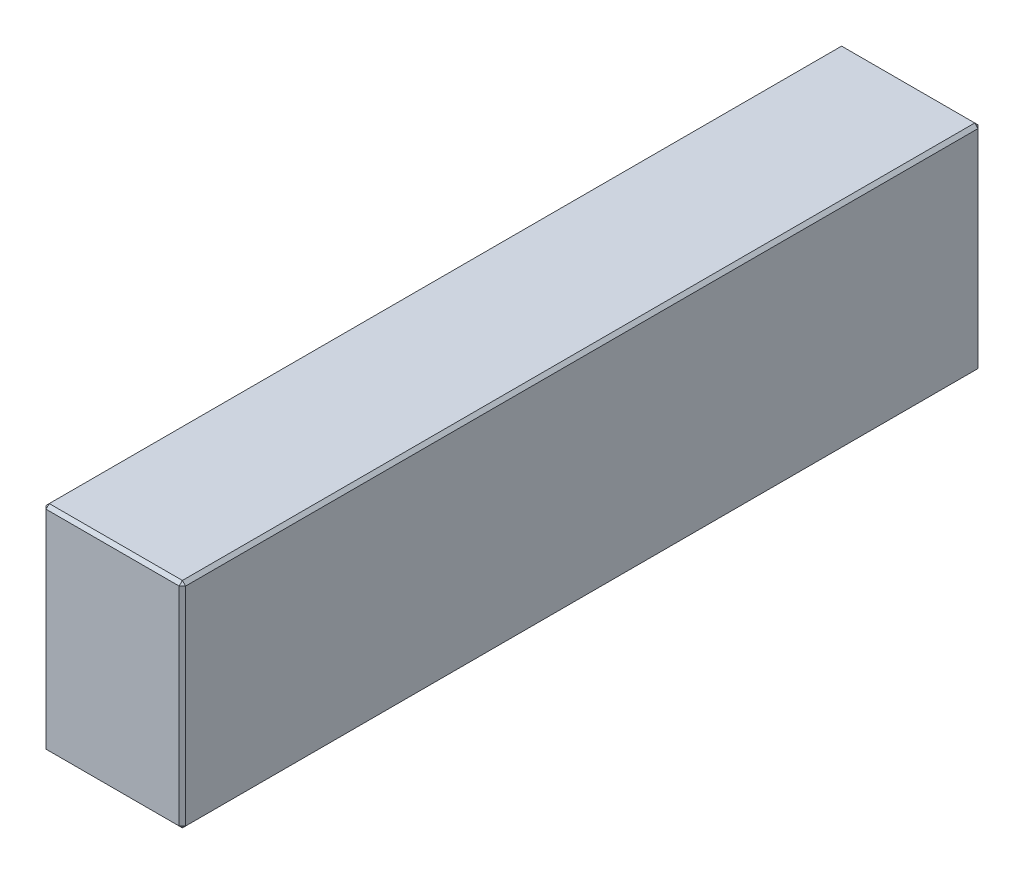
ISO-10303-21;
HEADER;
FILE_DESCRIPTION(('STEP AP214'),'2;1');
FILE_NAME('part.step','',(''),(''),'','','');
FILE_SCHEMA(('AUTOMOTIVE_DESIGN { 1 0 10303 214 1 1 1 1 }'));
ENDSEC;
DATA;
#1=APPLICATION_CONTEXT('core data for automotive mechanical design processes');
#2=APPLICATION_PROTOCOL_DEFINITION('international standard','automotive_design',2000,#1);
#3=PRODUCT_CONTEXT('',#1,'mechanical');
#4=PRODUCT('Part','Part','',(#3));
#5=PRODUCT_RELATED_PRODUCT_CATEGORY('part','',(#4));
#6=PRODUCT_DEFINITION_FORMATION('','',#4);
#7=PRODUCT_DEFINITION_CONTEXT('part definition',#1,'design');
#8=PRODUCT_DEFINITION('design','',#6,#7);
#9=PRODUCT_DEFINITION_SHAPE('','',#8);
#10=(LENGTH_UNIT() NAMED_UNIT(*) SI_UNIT(.MILLI.,.METRE.));
#11=(NAMED_UNIT(*) PLANE_ANGLE_UNIT() SI_UNIT($,.RADIAN.));
#12=(NAMED_UNIT(*) SI_UNIT($,.STERADIAN.) SOLID_ANGLE_UNIT());
#13=UNCERTAINTY_MEASURE_WITH_UNIT(LENGTH_MEASURE(1.E-05),#10,'distance_accuracy_value','');
#14=(GEOMETRIC_REPRESENTATION_CONTEXT(3) GLOBAL_UNCERTAINTY_ASSIGNED_CONTEXT((#13)) GLOBAL_UNIT_ASSIGNED_CONTEXT((#10,
#11,#12)) REPRESENTATION_CONTEXT('',''));
#15=CARTESIAN_POINT('',(0.,0.,0.));
#16=DIRECTION('',(0.,0.,1.));
#17=DIRECTION('',(1.,0.,0.));
#18=AXIS2_PLACEMENT_3D('',#15,#16,#17);
#19=CARTESIAN_POINT('',(-21.5,66.,123.));
#20=DIRECTION('',(1.,0.,0.));
#21=DIRECTION('',(0.,0.,-1.));
#22=AXIS2_PLACEMENT_3D('',#19,#20,#21);
#23=PLANE('',#22);
#24=DIRECTION('',(0.,-1.,0.));
#25=VECTOR('',#24,1.);
#26=CARTESIAN_POINT('',(-21.5,66.,-122.));
#27=LINE('',#26,#25);
#28=CARTESIAN_POINT('',(-21.5,65.,-122.));
#29=VERTEX_POINT('',#28);
#30=CARTESIAN_POINT('',(-21.5,1.,-122.));
#31=VERTEX_POINT('',#30);
#32=EDGE_CURVE('E114',#29,#31,#27,.T.);
#33=ORIENTED_EDGE('',*,*,#32,.T.);
#34=DIRECTION('',(0.,0.,1.));
#35=VECTOR('',#34,1.);
#36=CARTESIAN_POINT('',(-21.5,1.,123.));
#37=LINE('',#36,#35);
#38=CARTESIAN_POINT('',(-21.5,1.,122.));
#39=VERTEX_POINT('',#38);
#40=EDGE_CURVE('E110',#31,#39,#37,.T.);
#41=ORIENTED_EDGE('',*,*,#40,.T.);
#42=DIRECTION('',(0.,1.,0.));
#43=VECTOR('',#42,1.);
#44=CARTESIAN_POINT('',(-21.5,66.,122.));
#45=LINE('',#44,#43);
#46=CARTESIAN_POINT('',(-21.5,65.,122.));
#47=VERTEX_POINT('',#46);
#48=EDGE_CURVE('E103',#39,#47,#45,.T.);
#49=ORIENTED_EDGE('',*,*,#48,.T.);
#50=DIRECTION('',(0.,0.,-1.));
#51=VECTOR('',#50,1.);
#52=CARTESIAN_POINT('',(-21.5,65.,-123.));
#53=LINE('',#52,#51);
#54=EDGE_CURVE('E107',#47,#29,#53,.T.);
#55=ORIENTED_EDGE('',*,*,#54,.T.);
#56=EDGE_LOOP('',(#33,#41,#49,#55));
#57=FACE_BOUND('',#56,.T.);
#58=ADVANCED_FACE('F15',(#57),#23,.F.);
#59=CARTESIAN_POINT('',(21.5,66.,123.));
#60=DIRECTION('',(0.,0.,-1.));
#61=DIRECTION('',(-1.,0.,0.));
#62=AXIS2_PLACEMENT_3D('',#59,#60,#61);
#63=PLANE('',#62);
#64=DIRECTION('',(-1.,0.,0.));
#65=VECTOR('',#64,1.);
#66=CARTESIAN_POINT('',(-21.5,65.,123.));
#67=LINE('',#66,#65);
#68=CARTESIAN_POINT('',(20.5,65.,123.));
#69=VERTEX_POINT('',#68);
#70=CARTESIAN_POINT('',(-20.5,65.,123.));
#71=VERTEX_POINT('',#70);
#72=EDGE_CURVE('E164',#69,#71,#67,.T.);
#73=ORIENTED_EDGE('',*,*,#72,.T.);
#74=DIRECTION('',(0.,-1.,0.));
#75=VECTOR('',#74,1.);
#76=CARTESIAN_POINT('',(-20.5,66.,123.));
#77=LINE('',#76,#75);
#78=CARTESIAN_POINT('',(-20.5,1.,123.));
#79=VERTEX_POINT('',#78);
#80=EDGE_CURVE('E122',#71,#79,#77,.T.);
#81=ORIENTED_EDGE('',*,*,#80,.T.);
#82=DIRECTION('',(1.,0.,0.));
#83=VECTOR('',#82,1.);
#84=CARTESIAN_POINT('',(21.5,1.,123.));
#85=LINE('',#84,#83);
#86=CARTESIAN_POINT('',(20.5,1.,123.));
#87=VERTEX_POINT('',#86);
#88=EDGE_CURVE('E168',#79,#87,#85,.T.);
#89=ORIENTED_EDGE('',*,*,#88,.T.);
#90=DIRECTION('',(0.,1.,0.));
#91=VECTOR('',#90,1.);
#92=CARTESIAN_POINT('',(20.5,66.,123.));
#93=LINE('',#92,#91);
#94=EDGE_CURVE('E166',#87,#69,#93,.T.);
#95=ORIENTED_EDGE('',*,*,#94,.T.);
#96=EDGE_LOOP('',(#73,#81,#89,#95));
#97=FACE_BOUND('',#96,.T.);
#98=ADVANCED_FACE('F275',(#97),#63,.F.);
#99=CARTESIAN_POINT('',(21.5,66.,123.));
#100=DIRECTION('',(-1.,0.,0.));
#101=DIRECTION('',(0.,0.,1.));
#102=AXIS2_PLACEMENT_3D('',#99,#100,#101);
#103=PLANE('',#102);
#104=DIRECTION('',(0.,0.,-1.));
#105=VECTOR('',#104,1.);
#106=CARTESIAN_POINT('',(21.5,1.,123.));
#107=LINE('',#106,#105);
#108=CARTESIAN_POINT('',(21.5,1.,122.));
#109=VERTEX_POINT('',#108);
#110=CARTESIAN_POINT('',(21.5,1.,-122.));
#111=VERTEX_POINT('',#110);
#112=EDGE_CURVE('E159',#109,#111,#107,.T.);
#113=ORIENTED_EDGE('',*,*,#112,.T.);
#114=DIRECTION('',(0.,1.,0.));
#115=VECTOR('',#114,1.);
#116=CARTESIAN_POINT('',(21.5,66.,-122.));
#117=LINE('',#116,#115);
#118=CARTESIAN_POINT('',(21.5,65.,-122.));
#119=VERTEX_POINT('',#118);
#120=EDGE_CURVE('E161',#111,#119,#117,.T.);
#121=ORIENTED_EDGE('',*,*,#120,.T.);
#122=DIRECTION('',(0.,0.,1.));
#123=VECTOR('',#122,1.);
#124=CARTESIAN_POINT('',(21.5,65.,123.));
#125=LINE('',#124,#123);
#126=CARTESIAN_POINT('',(21.5,65.,122.));
#127=VERTEX_POINT('',#126);
#128=EDGE_CURVE('E155',#119,#127,#125,.T.);
#129=ORIENTED_EDGE('',*,*,#128,.T.);
#130=DIRECTION('',(0.,-1.,0.));
#131=VECTOR('',#130,1.);
#132=CARTESIAN_POINT('',(21.5,66.,122.));
#133=LINE('',#132,#131);
#134=EDGE_CURVE('E157',#127,#109,#133,.T.);
#135=ORIENTED_EDGE('',*,*,#134,.T.);
#136=EDGE_LOOP('',(#113,#121,#129,#135));
#137=FACE_BOUND('',#136,.T.);
#138=ADVANCED_FACE('F254',(#137),#103,.F.);
#139=CARTESIAN_POINT('',(21.5,66.,-123.));
#140=DIRECTION('',(0.,0.,1.));
#141=DIRECTION('',(1.,0.,0.));
#142=AXIS2_PLACEMENT_3D('',#139,#140,#141);
#143=PLANE('',#142);
#144=DIRECTION('',(0.,-1.,0.));
#145=VECTOR('',#144,1.);
#146=CARTESIAN_POINT('',(20.5,66.,-123.));
#147=LINE('',#146,#145);
#148=CARTESIAN_POINT('',(20.5,65.,-123.));
#149=VERTEX_POINT('',#148);
#150=CARTESIAN_POINT('',(20.5,1.,-123.));
#151=VERTEX_POINT('',#150);
#152=EDGE_CURVE('E148',#149,#151,#147,.T.);
#153=ORIENTED_EDGE('',*,*,#152,.T.);
#154=DIRECTION('',(-1.,0.,0.));
#155=VECTOR('',#154,1.);
#156=CARTESIAN_POINT('',(21.5,1.,-123.));
#157=LINE('',#156,#155);
#158=CARTESIAN_POINT('',(-20.5,1.,-123.));
#159=VERTEX_POINT('',#158);
#160=EDGE_CURVE('E153',#151,#159,#157,.T.);
#161=ORIENTED_EDGE('',*,*,#160,.T.);
#162=DIRECTION('',(0.,1.,0.));
#163=VECTOR('',#162,1.);
#164=CARTESIAN_POINT('',(-20.5,66.,-123.));
#165=LINE('',#164,#163);
#166=CARTESIAN_POINT('',(-20.5,65.,-123.));
#167=VERTEX_POINT('',#166);
#168=EDGE_CURVE('E150',#159,#167,#165,.T.);
#169=ORIENTED_EDGE('',*,*,#168,.T.);
#170=DIRECTION('',(1.,0.,0.));
#171=VECTOR('',#170,1.);
#172=CARTESIAN_POINT('',(21.5,65.,-123.));
#173=LINE('',#172,#171);
#174=EDGE_CURVE('E146',#167,#149,#173,.T.);
#175=ORIENTED_EDGE('',*,*,#174,.T.);
#176=EDGE_LOOP('',(#153,#161,#169,#175));
#177=FACE_BOUND('',#176,.T.);
#178=ADVANCED_FACE('F284',(#177),#143,.F.);
#179=CARTESIAN_POINT('',(0.,66.,0.));
#180=DIRECTION('',(0.,1.,0.));
#181=DIRECTION('',(0.,0.,1.));
#182=AXIS2_PLACEMENT_3D('',#179,#180,#181);
#183=PLANE('',#182);
#184=DIRECTION('',(0.,0.,-1.));
#185=VECTOR('',#184,1.);
#186=CARTESIAN_POINT('',(20.5,66.,-123.));
#187=LINE('',#186,#185);
#188=CARTESIAN_POINT('',(20.5,66.,122.));
#189=VERTEX_POINT('',#188);
#190=CARTESIAN_POINT('',(20.5,66.,-122.));
#191=VERTEX_POINT('',#190);
#192=EDGE_CURVE('E24',#189,#191,#187,.T.);
#193=ORIENTED_EDGE('',*,*,#192,.T.);
#194=DIRECTION('',(-1.,0.,0.));
#195=VECTOR('',#194,1.);
#196=CARTESIAN_POINT('',(-21.5,66.,-122.));
#197=LINE('',#196,#195);
#198=CARTESIAN_POINT('',(-20.5,66.,-122.));
#199=VERTEX_POINT('',#198);
#200=EDGE_CURVE('E9',#191,#199,#197,.T.);
#201=ORIENTED_EDGE('',*,*,#200,.T.);
#202=DIRECTION('',(0.,0.,1.));
#203=VECTOR('',#202,1.);
#204=CARTESIAN_POINT('',(-20.5,66.,123.));
#205=LINE('',#204,#203);
#206=CARTESIAN_POINT('',(-20.5,66.,122.));
#207=VERTEX_POINT('',#206);
#208=EDGE_CURVE('E180',#199,#207,#205,.T.);
#209=ORIENTED_EDGE('',*,*,#208,.T.);
#210=DIRECTION('',(1.,0.,0.));
#211=VECTOR('',#210,1.);
#212=CARTESIAN_POINT('',(21.5,66.,122.));
#213=LINE('',#212,#211);
#214=EDGE_CURVE('E35',#207,#189,#213,.T.);
#215=ORIENTED_EDGE('',*,*,#214,.T.);
#216=EDGE_LOOP('',(#193,#201,#209,#215));
#217=FACE_BOUND('',#216,.T.);
#218=ADVANCED_FACE('F350',(#217),#183,.T.);
#219=CARTESIAN_POINT('',(0.,0.,0.));
#220=DIRECTION('',(0.,1.,0.));
#221=DIRECTION('',(0.,0.,1.));
#222=AXIS2_PLACEMENT_3D('',#219,#220,#221);
#223=PLANE('',#222);
#224=DIRECTION('',(0.,0.,1.));
#225=VECTOR('',#224,1.);
#226=CARTESIAN_POINT('',(20.5,0.,0.));
#227=LINE('',#226,#225);
#228=CARTESIAN_POINT('',(20.5,0.,-122.));
#229=VERTEX_POINT('',#228);
#230=CARTESIAN_POINT('',(20.5,0.,122.));
#231=VERTEX_POINT('',#230);
#232=EDGE_CURVE('E171',#229,#231,#227,.T.);
#233=ORIENTED_EDGE('',*,*,#232,.T.);
#234=DIRECTION('',(-1.,0.,0.));
#235=VECTOR('',#234,1.);
#236=CARTESIAN_POINT('',(0.,0.,122.));
#237=LINE('',#236,#235);
#238=CARTESIAN_POINT('',(-20.5,0.,122.));
#239=VERTEX_POINT('',#238);
#240=EDGE_CURVE('E177',#231,#239,#237,.T.);
#241=ORIENTED_EDGE('',*,*,#240,.T.);
#242=DIRECTION('',(0.,0.,-1.));
#243=VECTOR('',#242,1.);
#244=CARTESIAN_POINT('',(-20.5,0.,0.));
#245=LINE('',#244,#243);
#246=CARTESIAN_POINT('',(-20.5,0.,-122.));
#247=VERTEX_POINT('',#246);
#248=EDGE_CURVE('E175',#239,#247,#245,.T.);
#249=ORIENTED_EDGE('',*,*,#248,.T.);
#250=DIRECTION('',(1.,0.,0.));
#251=VECTOR('',#250,1.);
#252=CARTESIAN_POINT('',(0.,0.,-122.));
#253=LINE('',#252,#251);
#254=EDGE_CURVE('E173',#247,#229,#253,.T.);
#255=ORIENTED_EDGE('',*,*,#254,.T.);
#256=EDGE_LOOP('',(#233,#241,#249,#255));
#257=FACE_BOUND('',#256,.T.);
#258=ADVANCED_FACE('F246',(#257),#223,.F.);
#259=CARTESIAN_POINT('',(21.5,66.,122.));
#260=DIRECTION('',(-0.707106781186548,0.,-0.707106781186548));
#261=DIRECTION('',(0.,-1.,0.));
#262=AXIS2_PLACEMENT_3D('',#259,#260,#261);
#263=PLANE('',#262);
#264=DIRECTION('',(-0.707106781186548,0.,0.707106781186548));
#265=VECTOR('',#264,1.);
#266=CARTESIAN_POINT('',(20.5,65.,123.));
#267=LINE('',#266,#265);
#268=EDGE_CURVE('E19',#69,#127,#267,.F.);
#269=ORIENTED_EDGE('',*,*,#268,.F.);
#270=ORIENTED_EDGE('',*,*,#94,.F.);
#271=DIRECTION('',(0.707106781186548,0.,-0.707106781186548));
#272=VECTOR('',#271,1.);
#273=CARTESIAN_POINT('',(20.5,1.,123.));
#274=LINE('',#273,#272);
#275=EDGE_CURVE('E142',#109,#87,#274,.F.);
#276=ORIENTED_EDGE('',*,*,#275,.F.);
#277=ORIENTED_EDGE('',*,*,#134,.F.);
#278=EDGE_LOOP('',(#269,#270,#276,#277));
#279=FACE_BOUND('',#278,.T.);
#280=ADVANCED_FACE('F17',(#279),#263,.F.);
#281=CARTESIAN_POINT('',(20.5,65.,123.));
#282=DIRECTION('',(0.577350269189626,0.577350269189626,0.577350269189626));
#283=DIRECTION('',(0.707106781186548,0.,-0.707106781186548));
#284=AXIS2_PLACEMENT_3D('',#281,#282,#283);
#285=PLANE('',#284);
#286=DIRECTION('',(0.,-0.707106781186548,0.707106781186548));
#287=VECTOR('',#286,1.);
#288=CARTESIAN_POINT('',(20.5,65.,123.));
#289=LINE('',#288,#287);
#290=EDGE_CURVE('E226',#69,#189,#289,.F.);
#291=ORIENTED_EDGE('',*,*,#290,.F.);
#292=ORIENTED_EDGE('',*,*,#268,.T.);
#293=DIRECTION('',(-0.707106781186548,0.707106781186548,0.));
#294=VECTOR('',#293,1.);
#295=CARTESIAN_POINT('',(21.,65.5,122.));
#296=LINE('',#295,#294);
#297=EDGE_CURVE('E228',#189,#127,#296,.F.);
#298=ORIENTED_EDGE('',*,*,#297,.F.);
#299=EDGE_LOOP('',(#291,#292,#298));
#300=FACE_BOUND('',#299,.T.);
#301=ADVANCED_FACE('F270',(#300),#285,.T.);
#302=CARTESIAN_POINT('',(20.5,1.,123.));
#303=DIRECTION('',(0.577350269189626,-0.577350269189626,0.577350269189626));
#304=DIRECTION('',(0.707106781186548,0.,-0.707106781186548));
#305=AXIS2_PLACEMENT_3D('',#302,#303,#304);
#306=PLANE('',#305);
#307=DIRECTION('',(-0.707106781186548,-0.707106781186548,0.));
#308=VECTOR('',#307,1.);
#309=CARTESIAN_POINT('',(21.,0.5,122.));
#310=LINE('',#309,#308);
#311=EDGE_CURVE('E220',#109,#231,#310,.T.);
#312=ORIENTED_EDGE('',*,*,#311,.F.);
#313=ORIENTED_EDGE('',*,*,#275,.T.);
#314=DIRECTION('',(0.,0.707106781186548,0.707106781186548));
#315=VECTOR('',#314,1.);
#316=CARTESIAN_POINT('',(20.5,1.,123.));
#317=LINE('',#316,#315);
#318=EDGE_CURVE('E223',#231,#87,#317,.T.);
#319=ORIENTED_EDGE('',*,*,#318,.F.);
#320=EDGE_LOOP('',(#312,#313,#319));
#321=FACE_BOUND('',#320,.T.);
#322=ADVANCED_FACE('F235',(#321),#306,.T.);
#323=CARTESIAN_POINT('',(20.5,66.,0.));
#324=DIRECTION('',(0.707106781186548,0.707106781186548,0.));
#325=DIRECTION('',(0.,0.,1.));
#326=AXIS2_PLACEMENT_3D('',#323,#324,#325);
#327=PLANE('',#326);
#328=ORIENTED_EDGE('',*,*,#297,.T.);
#329=ORIENTED_EDGE('',*,*,#128,.F.);
#330=DIRECTION('',(0.707106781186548,-0.707106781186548,0.));
#331=VECTOR('',#330,1.);
#332=CARTESIAN_POINT('',(21.5,65.,-122.));
#333=LINE('',#332,#331);
#334=EDGE_CURVE('E215',#191,#119,#333,.T.);
#335=ORIENTED_EDGE('',*,*,#334,.F.);
#336=ORIENTED_EDGE('',*,*,#192,.F.);
#337=EDGE_LOOP('',(#328,#329,#335,#336));
#338=FACE_BOUND('',#337,.T.);
#339=ADVANCED_FACE('F265',(#338),#327,.T.);
#340=CARTESIAN_POINT('',(0.,66.,122.));
#341=DIRECTION('',(0.,0.707106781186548,0.707106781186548));
#342=DIRECTION('',(-1.,0.,0.));
#343=AXIS2_PLACEMENT_3D('',#340,#341,#342);
#344=PLANE('',#343);
#345=ORIENTED_EDGE('',*,*,#290,.T.);
#346=ORIENTED_EDGE('',*,*,#214,.F.);
#347=DIRECTION('',(0.,0.707106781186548,-0.707106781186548));
#348=VECTOR('',#347,1.);
#349=CARTESIAN_POINT('',(-20.5,65.5,122.5));
#350=LINE('',#349,#348);
#351=EDGE_CURVE('E126',#71,#207,#350,.T.);
#352=ORIENTED_EDGE('',*,*,#351,.F.);
#353=ORIENTED_EDGE('',*,*,#72,.F.);
#354=EDGE_LOOP('',(#345,#346,#352,#353));
#355=FACE_BOUND('',#354,.T.);
#356=ADVANCED_FACE('F273',(#355),#344,.T.);
#357=CARTESIAN_POINT('',(-20.5,66.,123.));
#358=DIRECTION('',(0.707106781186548,0.,-0.707106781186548));
#359=DIRECTION('',(0.,-1.,0.));
#360=AXIS2_PLACEMENT_3D('',#357,#358,#359);
#361=PLANE('',#360);
#362=DIRECTION('',(0.707106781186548,0.,0.707106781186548));
#363=VECTOR('',#362,1.);
#364=CARTESIAN_POINT('',(-20.5,1.,123.));
#365=LINE('',#364,#363);
#366=EDGE_CURVE('E127',#79,#39,#365,.F.);
#367=ORIENTED_EDGE('',*,*,#366,.F.);
#368=ORIENTED_EDGE('',*,*,#80,.F.);
#369=DIRECTION('',(-0.707106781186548,0.,-0.707106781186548));
#370=VECTOR('',#369,1.);
#371=CARTESIAN_POINT('',(-21.5,65.,122.));
#372=LINE('',#371,#370);
#373=EDGE_CURVE('E118',#47,#71,#372,.F.);
#374=ORIENTED_EDGE('',*,*,#373,.F.);
#375=ORIENTED_EDGE('',*,*,#48,.F.);
#376=EDGE_LOOP('',(#367,#368,#374,#375));
#377=FACE_BOUND('',#376,.T.);
#378=ADVANCED_FACE('F120',(#377),#361,.F.);
#379=CARTESIAN_POINT('',(21.5,1.,123.));
#380=DIRECTION('',(0.,0.707106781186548,-0.707106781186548));
#381=DIRECTION('',(1.,0.,0.));
#382=AXIS2_PLACEMENT_3D('',#379,#380,#381);
#383=PLANE('',#382);
#384=ORIENTED_EDGE('',*,*,#318,.T.);
#385=ORIENTED_EDGE('',*,*,#88,.F.);
#386=DIRECTION('',(0.,-0.707106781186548,-0.707106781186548));
#387=VECTOR('',#386,1.);
#388=CARTESIAN_POINT('',(-20.5,1.,123.));
#389=LINE('',#388,#387);
#390=EDGE_CURVE('E211',#239,#79,#389,.F.);
#391=ORIENTED_EDGE('',*,*,#390,.F.);
#392=ORIENTED_EDGE('',*,*,#240,.F.);
#393=EDGE_LOOP('',(#384,#385,#391,#392));
#394=FACE_BOUND('',#393,.T.);
#395=ADVANCED_FACE('F243',(#394),#383,.F.);
#396=CARTESIAN_POINT('',(21.5,1.,123.));
#397=DIRECTION('',(-0.707106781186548,0.707106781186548,0.));
#398=DIRECTION('',(0.,0.,-1.));
#399=AXIS2_PLACEMENT_3D('',#396,#397,#398);
#400=PLANE('',#399);
#401=ORIENTED_EDGE('',*,*,#311,.T.);
#402=ORIENTED_EDGE('',*,*,#232,.F.);
#403=DIRECTION('',(0.707106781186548,0.707106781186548,0.));
#404=VECTOR('',#403,1.);
#405=CARTESIAN_POINT('',(21.,0.5,-122.));
#406=LINE('',#405,#404);
#407=EDGE_CURVE('E208',#111,#229,#406,.F.);
#408=ORIENTED_EDGE('',*,*,#407,.F.);
#409=ORIENTED_EDGE('',*,*,#112,.F.);
#410=EDGE_LOOP('',(#401,#402,#408,#409));
#411=FACE_BOUND('',#410,.T.);
#412=ADVANCED_FACE('F251',(#411),#400,.F.);
#413=CARTESIAN_POINT('',(20.5,66.,-123.));
#414=DIRECTION('',(-0.707106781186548,0.,0.707106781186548));
#415=DIRECTION('',(0.,-1.,0.));
#416=AXIS2_PLACEMENT_3D('',#413,#414,#415);
#417=PLANE('',#416);
#418=DIRECTION('',(0.707106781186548,0.,0.707106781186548));
#419=VECTOR('',#418,1.);
#420=CARTESIAN_POINT('',(21.5,65.,-122.));
#421=LINE('',#420,#419);
#422=EDGE_CURVE('E217',#119,#149,#421,.F.);
#423=ORIENTED_EDGE('',*,*,#422,.F.);
#424=ORIENTED_EDGE('',*,*,#120,.F.);
#425=DIRECTION('',(-0.707106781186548,0.,-0.707106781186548));
#426=VECTOR('',#425,1.);
#427=CARTESIAN_POINT('',(20.5,1.,-123.));
#428=LINE('',#427,#426);
#429=EDGE_CURVE('E205',#151,#111,#428,.F.);
#430=ORIENTED_EDGE('',*,*,#429,.F.);
#431=ORIENTED_EDGE('',*,*,#152,.F.);
#432=EDGE_LOOP('',(#423,#424,#430,#431));
#433=FACE_BOUND('',#432,.T.);
#434=ADVANCED_FACE('F258',(#433),#417,.F.);
#435=CARTESIAN_POINT('',(21.5,65.,-122.));
#436=DIRECTION('',(0.577350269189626,0.577350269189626,-0.577350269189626));
#437=DIRECTION('',(-0.707106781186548,0.,-0.707106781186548));
#438=AXIS2_PLACEMENT_3D('',#435,#436,#437);
#439=PLANE('',#438);
#440=ORIENTED_EDGE('',*,*,#334,.T.);
#441=ORIENTED_EDGE('',*,*,#422,.T.);
#442=DIRECTION('',(0.,0.707106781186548,0.707106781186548));
#443=VECTOR('',#442,1.);
#444=CARTESIAN_POINT('',(20.5,65.5,-122.5));
#445=LINE('',#444,#443);
#446=EDGE_CURVE('E134',#191,#149,#445,.F.);
#447=ORIENTED_EDGE('',*,*,#446,.F.);
#448=EDGE_LOOP('',(#440,#441,#447));
#449=FACE_BOUND('',#448,.T.);
#450=ADVANCED_FACE('F325',(#449),#439,.T.);
#451=CARTESIAN_POINT('',(-21.5,65.,122.));
#452=DIRECTION('',(-0.577350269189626,0.577350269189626,0.577350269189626));
#453=DIRECTION('',(0.707106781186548,0.,0.707106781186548));
#454=AXIS2_PLACEMENT_3D('',#451,#452,#453);
#455=PLANE('',#454);
#456=ORIENTED_EDGE('',*,*,#373,.T.);
#457=ORIENTED_EDGE('',*,*,#351,.T.);
#458=DIRECTION('',(-0.707106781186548,-0.707106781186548,0.));
#459=VECTOR('',#458,1.);
#460=CARTESIAN_POINT('',(-21.5,65.,122.));
#461=LINE('',#460,#459);
#462=EDGE_CURVE('E130',#47,#207,#461,.F.);
#463=ORIENTED_EDGE('',*,*,#462,.F.);
#464=EDGE_LOOP('',(#456,#457,#463));
#465=FACE_BOUND('',#464,.T.);
#466=ADVANCED_FACE('F131',(#465),#455,.T.);
#467=CARTESIAN_POINT('',(-20.5,1.,123.));
#468=DIRECTION('',(-0.577350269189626,-0.577350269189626,0.577350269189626));
#469=DIRECTION('',(0.707106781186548,0.,0.707106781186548));
#470=AXIS2_PLACEMENT_3D('',#467,#468,#469);
#471=PLANE('',#470);
#472=ORIENTED_EDGE('',*,*,#390,.T.);
#473=ORIENTED_EDGE('',*,*,#366,.T.);
#474=DIRECTION('',(-0.707106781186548,0.707106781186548,0.));
#475=VECTOR('',#474,1.);
#476=CARTESIAN_POINT('',(-21.,0.5,122.));
#477=LINE('',#476,#475);
#478=EDGE_CURVE('E135',#239,#39,#477,.T.);
#479=ORIENTED_EDGE('',*,*,#478,.F.);
#480=EDGE_LOOP('',(#472,#473,#479));
#481=FACE_BOUND('',#480,.T.);
#482=ADVANCED_FACE('F318',(#481),#471,.T.);
#483=CARTESIAN_POINT('',(20.5,1.,-123.));
#484=DIRECTION('',(0.577350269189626,-0.577350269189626,-0.577350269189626));
#485=DIRECTION('',(-0.707106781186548,0.,-0.707106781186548));
#486=AXIS2_PLACEMENT_3D('',#483,#484,#485);
#487=PLANE('',#486);
#488=ORIENTED_EDGE('',*,*,#429,.T.);
#489=ORIENTED_EDGE('',*,*,#407,.T.);
#490=DIRECTION('',(0.,-0.707106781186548,0.707106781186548));
#491=VECTOR('',#490,1.);
#492=CARTESIAN_POINT('',(20.5,1.,-123.));
#493=LINE('',#492,#491);
#494=EDGE_CURVE('E198',#151,#229,#493,.T.);
#495=ORIENTED_EDGE('',*,*,#494,.F.);
#496=EDGE_LOOP('',(#488,#489,#495));
#497=FACE_BOUND('',#496,.T.);
#498=ADVANCED_FACE('F314',(#497),#487,.T.);
#499=CARTESIAN_POINT('',(0.,66.,-122.));
#500=DIRECTION('',(0.,0.707106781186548,-0.707106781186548));
#501=DIRECTION('',(1.,0.,0.));
#502=AXIS2_PLACEMENT_3D('',#499,#500,#501);
#503=PLANE('',#502);
#504=ORIENTED_EDGE('',*,*,#446,.T.);
#505=ORIENTED_EDGE('',*,*,#174,.F.);
#506=DIRECTION('',(0.,-0.707106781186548,-0.707106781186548));
#507=VECTOR('',#506,1.);
#508=CARTESIAN_POINT('',(-20.5,65.,-123.));
#509=LINE('',#508,#507);
#510=EDGE_CURVE('E195',#199,#167,#509,.T.);
#511=ORIENTED_EDGE('',*,*,#510,.F.);
#512=ORIENTED_EDGE('',*,*,#200,.F.);
#513=EDGE_LOOP('',(#504,#505,#511,#512));
#514=FACE_BOUND('',#513,.T.);
#515=ADVANCED_FACE('F311',(#514),#503,.T.);
#516=CARTESIAN_POINT('',(-20.5,66.,0.));
#517=DIRECTION('',(-0.707106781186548,0.707106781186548,0.));
#518=DIRECTION('',(0.,0.,-1.));
#519=AXIS2_PLACEMENT_3D('',#516,#517,#518);
#520=PLANE('',#519);
#521=ORIENTED_EDGE('',*,*,#462,.T.);
#522=ORIENTED_EDGE('',*,*,#208,.F.);
#523=DIRECTION('',(0.707106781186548,0.707106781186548,0.));
#524=VECTOR('',#523,1.);
#525=CARTESIAN_POINT('',(-21.,65.5,-122.));
#526=LINE('',#525,#524);
#527=EDGE_CURVE('E138',#29,#199,#526,.T.);
#528=ORIENTED_EDGE('',*,*,#527,.F.);
#529=ORIENTED_EDGE('',*,*,#54,.F.);
#530=EDGE_LOOP('',(#521,#522,#528,#529));
#531=FACE_BOUND('',#530,.T.);
#532=ADVANCED_FACE('F137',(#531),#520,.T.);
#533=CARTESIAN_POINT('',(-21.5,1.,123.));
#534=DIRECTION('',(0.707106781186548,0.707106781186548,0.));
#535=DIRECTION('',(0.,0.,1.));
#536=AXIS2_PLACEMENT_3D('',#533,#534,#535);
#537=PLANE('',#536);
#538=ORIENTED_EDGE('',*,*,#478,.T.);
#539=ORIENTED_EDGE('',*,*,#40,.F.);
#540=DIRECTION('',(0.707106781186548,-0.707106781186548,0.));
#541=VECTOR('',#540,1.);
#542=CARTESIAN_POINT('',(-21.5,1.,-122.));
#543=LINE('',#542,#541);
#544=EDGE_CURVE('E191',#247,#31,#543,.F.);
#545=ORIENTED_EDGE('',*,*,#544,.F.);
#546=ORIENTED_EDGE('',*,*,#248,.F.);
#547=EDGE_LOOP('',(#538,#539,#545,#546));
#548=FACE_BOUND('',#547,.T.);
#549=ADVANCED_FACE('F304',(#548),#537,.F.);
#550=CARTESIAN_POINT('',(21.5,1.,-123.));
#551=DIRECTION('',(0.,0.707106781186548,0.707106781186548));
#552=DIRECTION('',(-1.,0.,0.));
#553=AXIS2_PLACEMENT_3D('',#550,#551,#552);
#554=PLANE('',#553);
#555=ORIENTED_EDGE('',*,*,#494,.T.);
#556=ORIENTED_EDGE('',*,*,#254,.F.);
#557=DIRECTION('',(0.,0.707106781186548,-0.707106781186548));
#558=VECTOR('',#557,1.);
#559=CARTESIAN_POINT('',(-20.5,0.5,-122.5));
#560=LINE('',#559,#558);
#561=EDGE_CURVE('E188',#159,#247,#560,.F.);
#562=ORIENTED_EDGE('',*,*,#561,.F.);
#563=ORIENTED_EDGE('',*,*,#160,.F.);
#564=EDGE_LOOP('',(#555,#556,#562,#563));
#565=FACE_BOUND('',#564,.T.);
#566=ADVANCED_FACE('F300',(#565),#554,.F.);
#567=CARTESIAN_POINT('',(-20.5,65.,-123.));
#568=DIRECTION('',(-0.577350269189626,0.577350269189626,-0.577350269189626));
#569=DIRECTION('',(-0.707106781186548,0.,0.707106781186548));
#570=AXIS2_PLACEMENT_3D('',#567,#568,#569);
#571=PLANE('',#570);
#572=ORIENTED_EDGE('',*,*,#527,.T.);
#573=ORIENTED_EDGE('',*,*,#510,.T.);
#574=DIRECTION('',(0.707106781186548,0.,-0.707106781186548));
#575=VECTOR('',#574,1.);
#576=CARTESIAN_POINT('',(-20.5,65.,-123.));
#577=LINE('',#576,#575);
#578=EDGE_CURVE('E186',#29,#167,#577,.T.);
#579=ORIENTED_EDGE('',*,*,#578,.F.);
#580=EDGE_LOOP('',(#572,#573,#579));
#581=FACE_BOUND('',#580,.T.);
#582=ADVANCED_FACE('F296',(#581),#571,.T.);
#583=CARTESIAN_POINT('',(-21.5,1.,-122.));
#584=DIRECTION('',(-0.577350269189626,-0.577350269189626,-0.577350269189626));
#585=DIRECTION('',(-0.707106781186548,0.,0.707106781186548));
#586=AXIS2_PLACEMENT_3D('',#583,#584,#585);
#587=PLANE('',#586);
#588=ORIENTED_EDGE('',*,*,#561,.T.);
#589=ORIENTED_EDGE('',*,*,#544,.T.);
#590=DIRECTION('',(-0.707106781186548,0.,0.707106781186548));
#591=VECTOR('',#590,1.);
#592=CARTESIAN_POINT('',(-21.5,1.,-122.));
#593=LINE('',#592,#591);
#594=EDGE_CURVE('E184',#159,#31,#593,.T.);
#595=ORIENTED_EDGE('',*,*,#594,.F.);
#596=EDGE_LOOP('',(#588,#589,#595));
#597=FACE_BOUND('',#596,.T.);
#598=ADVANCED_FACE('F292',(#597),#587,.T.);
#599=CARTESIAN_POINT('',(-21.5,66.,-122.));
#600=DIRECTION('',(0.707106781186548,0.,0.707106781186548));
#601=DIRECTION('',(0.,-1.,0.));
#602=AXIS2_PLACEMENT_3D('',#599,#600,#601);
#603=PLANE('',#602);
#604=ORIENTED_EDGE('',*,*,#578,.T.);
#605=ORIENTED_EDGE('',*,*,#168,.F.);
#606=ORIENTED_EDGE('',*,*,#594,.T.);
#607=ORIENTED_EDGE('',*,*,#32,.F.);
#608=EDGE_LOOP('',(#604,#605,#606,#607));
#609=FACE_BOUND('',#608,.T.);
#610=ADVANCED_FACE('F289',(#609),#603,.F.);
#611=CLOSED_SHELL('',(#58,#98,#138,#178,#218,#258,#280,#301,#322,#339,#356,#378,#395,#412,#434,
#450,#466,#482,#498,#515,#532,#549,#566,#582,#598,#610));
#612=MANIFOLD_SOLID_BREP('B1',#611);
#613=ADVANCED_BREP_SHAPE_REPRESENTATION('',(#18,#612),#14);
#614=SHAPE_DEFINITION_REPRESENTATION(#9,#613);
ENDSEC;
END-ISO-10303-21;
